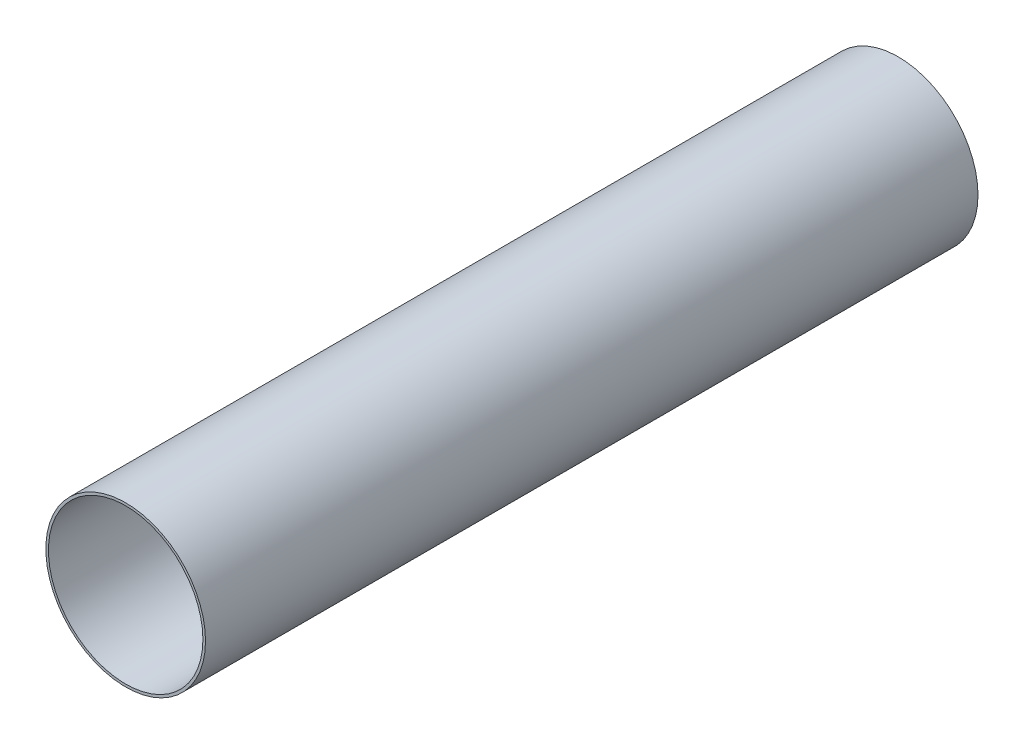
from build123d import *

# Parameters (mm, degrees)
ESQUISSE1_R      = 1.55
ESQUISSE1_R_2    = 1.5
EXTRUSION1_DEPTH = 15


with BuildPart() as part:
    # Esquisse1 → Extrusion1 (new body)
    with BuildSketch(Plane.XY):
        Circle(ESQUISSE1_R)
        Circle(ESQUISSE1_R_2, mode=Mode.SUBTRACT)
    extrude(amount=EXTRUSION1_DEPTH)


solid = part.part
